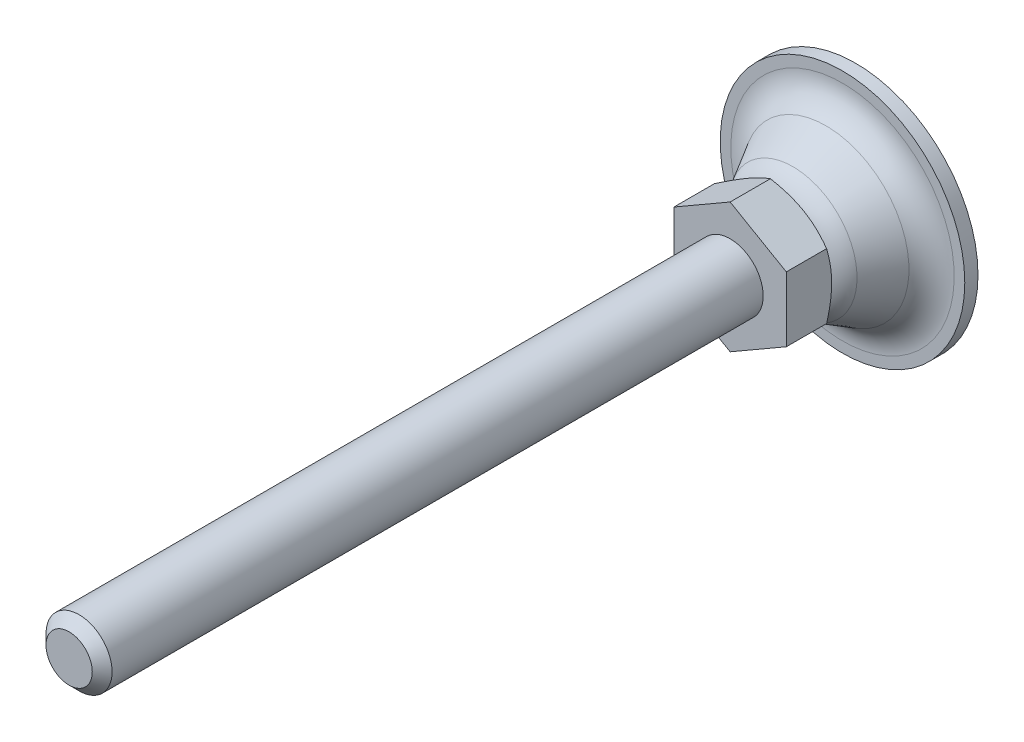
ISO-10303-21;
HEADER;
FILE_DESCRIPTION(('STEP AP214'),'2;1');
FILE_NAME('part.step','',(''),(''),'','','');
FILE_SCHEMA(('AUTOMOTIVE_DESIGN { 1 0 10303 214 1 1 1 1 }'));
ENDSEC;
DATA;
#1=APPLICATION_CONTEXT('core data for automotive mechanical design processes');
#2=APPLICATION_PROTOCOL_DEFINITION('international standard','automotive_design',2000,#1);
#3=PRODUCT_CONTEXT('',#1,'mechanical');
#4=PRODUCT('Part','Part','',(#3));
#5=PRODUCT_RELATED_PRODUCT_CATEGORY('part','',(#4));
#6=PRODUCT_DEFINITION_FORMATION('','',#4);
#7=PRODUCT_DEFINITION_CONTEXT('part definition',#1,'design');
#8=PRODUCT_DEFINITION('design','',#6,#7);
#9=PRODUCT_DEFINITION_SHAPE('','',#8);
#10=(LENGTH_UNIT() NAMED_UNIT(*) SI_UNIT(.MILLI.,.METRE.));
#11=(NAMED_UNIT(*) PLANE_ANGLE_UNIT() SI_UNIT($,.RADIAN.));
#12=(NAMED_UNIT(*) SI_UNIT($,.STERADIAN.) SOLID_ANGLE_UNIT());
#13=UNCERTAINTY_MEASURE_WITH_UNIT(LENGTH_MEASURE(1.E-05),#10,'distance_accuracy_value','');
#14=(GEOMETRIC_REPRESENTATION_CONTEXT(3) GLOBAL_UNCERTAINTY_ASSIGNED_CONTEXT((#13)) GLOBAL_UNIT_ASSIGNED_CONTEXT((#10,
#11,#12)) REPRESENTATION_CONTEXT('',''));
#15=CARTESIAN_POINT('',(0.,0.,0.));
#16=DIRECTION('',(0.,0.,1.));
#17=DIRECTION('',(1.,0.,0.));
#18=AXIS2_PLACEMENT_3D('',#15,#16,#17);
#19=CARTESIAN_POINT('',(-9.25,16.0214699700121,1.99999918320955));
#20=DIRECTION('',(0.,0.,-1.));
#21=DIRECTION('',(-0.5,0.866025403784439,0.));
#22=AXIS2_PLACEMENT_3D('',#19,#20,#21);
#23=PLANE('',#22);
#24=CARTESIAN_POINT('',(0.,0.,1.99999918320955));
#25=DIRECTION('',(0.,0.,1.));
#26=DIRECTION('',(0.5,-0.866025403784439,0.));
#27=AXIS2_PLACEMENT_3D('',#24,#25,#26);
#28=CIRCLE('',#27,16.8976413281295);
#29=CARTESIAN_POINT('',(8.44882066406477,-14.633786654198,1.99999918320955));
#30=VERTEX_POINT('',#29);
#31=EDGE_CURVE('E108',#30,#30,#28,.T.);
#32=ORIENTED_EDGE('',*,*,#31,.F.);
#33=EDGE_LOOP('',(#32));
#34=FACE_BOUND('',#33,.T.);
#35=CARTESIAN_POINT('',(0.,0.,2.));
#36=DIRECTION('',(0.,0.,1.));
#37=DIRECTION('',(1.,0.,0.));
#38=AXIS2_PLACEMENT_3D('',#35,#36,#37);
#39=CIRCLE('',#38,18.5);
#40=CARTESIAN_POINT('',(18.5,0.,2.));
#41=VERTEX_POINT('',#40);
#42=EDGE_CURVE('E245',#41,#41,#39,.T.);
#43=ORIENTED_EDGE('',*,*,#42,.T.);
#44=EDGE_LOOP('',(#43));
#45=FACE_BOUND('',#44,.T.);
#46=ADVANCED_FACE('F14',(#34,#45),#23,.F.);
#47=CARTESIAN_POINT('',(0.,0.,19.));
#48=DIRECTION('',(0.,0.,1.));
#49=DIRECTION('',(0.5,-0.866025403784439,0.));
#50=AXIS2_PLACEMENT_3D('',#47,#48,#49);
#51=PLANE('',#50);
#52=DIRECTION('',(0.,1.,0.));
#53=VECTOR('',#52,1.);
#54=CARTESIAN_POINT('',(8.5,-4.90747728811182,19.));
#55=LINE('',#54,#53);
#56=CARTESIAN_POINT('',(8.5,-4.90747728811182,19.));
#57=VERTEX_POINT('',#56);
#58=CARTESIAN_POINT('',(8.5,4.90747728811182,19.));
#59=VERTEX_POINT('',#58);
#60=EDGE_CURVE('E179',#57,#59,#55,.T.);
#61=ORIENTED_EDGE('',*,*,#60,.T.);
#62=DIRECTION('',(-0.866025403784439,0.5,0.));
#63=VECTOR('',#62,1.);
#64=CARTESIAN_POINT('',(8.5,4.90747728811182,19.));
#65=LINE('',#64,#63);
#66=CARTESIAN_POINT('',(0.,9.81495457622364,19.));
#67=VERTEX_POINT('',#66);
#68=EDGE_CURVE('E181',#59,#67,#65,.T.);
#69=ORIENTED_EDGE('',*,*,#68,.T.);
#70=DIRECTION('',(-0.866025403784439,-0.5,0.));
#71=VECTOR('',#70,1.);
#72=CARTESIAN_POINT('',(0.,9.81495457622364,19.));
#73=LINE('',#72,#71);
#74=CARTESIAN_POINT('',(-8.5,4.90747728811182,19.));
#75=VERTEX_POINT('',#74);
#76=EDGE_CURVE('E183',#67,#75,#73,.T.);
#77=ORIENTED_EDGE('',*,*,#76,.T.);
#78=DIRECTION('',(0.,-1.,0.));
#79=VECTOR('',#78,1.);
#80=CARTESIAN_POINT('',(-8.5,4.90747728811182,19.));
#81=LINE('',#80,#79);
#82=CARTESIAN_POINT('',(-8.5,-4.90747728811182,19.));
#83=VERTEX_POINT('',#82);
#84=EDGE_CURVE('E185',#75,#83,#81,.T.);
#85=ORIENTED_EDGE('',*,*,#84,.T.);
#86=DIRECTION('',(0.866025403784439,-0.5,0.));
#87=VECTOR('',#86,1.);
#88=CARTESIAN_POINT('',(-8.5,-4.90747728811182,19.));
#89=LINE('',#88,#87);
#90=CARTESIAN_POINT('',(0.,-9.81495457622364,19.));
#91=VERTEX_POINT('',#90);
#92=EDGE_CURVE('E187',#83,#91,#89,.T.);
#93=ORIENTED_EDGE('',*,*,#92,.T.);
#94=DIRECTION('',(0.866025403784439,0.5,0.));
#95=VECTOR('',#94,1.);
#96=CARTESIAN_POINT('',(0.,-9.81495457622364,19.));
#97=LINE('',#96,#95);
#98=EDGE_CURVE('E37',#91,#57,#97,.T.);
#99=ORIENTED_EDGE('',*,*,#98,.T.);
#100=EDGE_LOOP('',(#61,#69,#77,#85,#93,#99));
#101=FACE_BOUND('',#100,.T.);
#102=CARTESIAN_POINT('',(0.,0.,19.));
#103=DIRECTION('',(0.,0.,1.));
#104=DIRECTION('',(0.5,-0.866025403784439,0.));
#105=AXIS2_PLACEMENT_3D('',#102,#103,#104);
#106=CIRCLE('',#105,5.);
#107=CARTESIAN_POINT('',(2.5,-4.3301270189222,19.));
#108=VERTEX_POINT('',#107);
#109=EDGE_CURVE('E243',#108,#108,#106,.T.);
#110=ORIENTED_EDGE('',*,*,#109,.F.);
#111=EDGE_LOOP('',(#110));
#112=FACE_BOUND('',#111,.T.);
#113=ADVANCED_FACE('F188',(#101,#112),#51,.T.);
#114=CARTESIAN_POINT('',(0.,0.,12.));
#115=DIRECTION('',(0.,0.,1.));
#116=DIRECTION('',(0.5,-0.866025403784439,0.));
#117=AXIS2_PLACEMENT_3D('',#114,#115,#116);
#118=PLANE('',#117);
#119=CARTESIAN_POINT('',(0.,0.,12.));
#120=DIRECTION('',(0.,0.,1.));
#121=DIRECTION('',(0.5,-0.866025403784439,0.));
#122=AXIS2_PLACEMENT_3D('',#119,#120,#121);
#123=CIRCLE('',#122,5.36011171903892);
#124=CARTESIAN_POINT('',(2.68005585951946,-4.64199291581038,12.));
#125=VERTEX_POINT('',#124);
#126=EDGE_CURVE('E73',#125,#125,#123,.T.);
#127=ORIENTED_EDGE('',*,*,#126,.T.);
#128=EDGE_LOOP('',(#127));
#129=FACE_BOUND('',#128,.T.);
#130=CARTESIAN_POINT('',(0.,0.,12.));
#131=DIRECTION('',(0.,0.,1.));
#132=DIRECTION('',(0.5,-0.866025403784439,0.));
#133=AXIS2_PLACEMENT_3D('',#130,#131,#132);
#134=CIRCLE('',#133,8.25);
#135=CARTESIAN_POINT('',(4.125,-7.14470958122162,12.));
#136=VERTEX_POINT('',#135);
#137=EDGE_CURVE('E84',#136,#136,#134,.T.);
#138=ORIENTED_EDGE('',*,*,#137,.F.);
#139=EDGE_LOOP('',(#138));
#140=FACE_BOUND('',#139,.T.);
#141=ADVANCED_FACE('F125',(#129,#140),#118,.F.);
#142=CARTESIAN_POINT('',(0.,0.,7.));
#143=DIRECTION('',(0.,0.,1.));
#144=DIRECTION('',(0.5,-0.866025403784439,0.));
#145=AXIS2_PLACEMENT_3D('',#142,#143,#144);
#146=TOROIDAL_SURFACE('',#145,5.36011171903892,5.);
#147=ORIENTED_EDGE('',*,*,#126,.F.);
#148=EDGE_LOOP('',(#147));
#149=FACE_BOUND('',#148,.T.);
#150=CARTESIAN_POINT('',(0.,0.,9.49382979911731));
#151=DIRECTION('',(0.,0.,1.));
#152=DIRECTION('',(0.5,-0.866025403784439,0.));
#153=AXIS2_PLACEMENT_3D('',#150,#151,#152);
#154=CIRCLE('',#153,9.69379524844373);
#155=CARTESIAN_POINT('',(4.84689762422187,-8.39507294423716,9.49382979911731));
#156=VERTEX_POINT('',#155);
#157=EDGE_CURVE('E102',#156,#156,#154,.T.);
#158=ORIENTED_EDGE('',*,*,#157,.T.);
#159=EDGE_LOOP('',(#158));
#160=FACE_BOUND('',#159,.T.);
#161=ADVANCED_FACE('F214',(#149,#160),#146,.T.);
#162=CARTESIAN_POINT('',(0.,0.,6.99999918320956));
#163=DIRECTION('',(0.,0.,1.));
#164=DIRECTION('',(0.5,-0.866025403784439,0.));
#165=AXIS2_PLACEMENT_3D('',#162,#163,#164);
#166=TOROIDAL_SURFACE('',#165,16.8976413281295,5.);
#167=CARTESIAN_POINT('',(0.,0.,4.50616938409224));
#168=DIRECTION('',(0.,0.,1.));
#169=DIRECTION('',(0.5,-0.866025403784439,0.));
#170=AXIS2_PLACEMENT_3D('',#167,#168,#169);
#171=CIRCLE('',#170,12.5639577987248);
#172=CARTESIAN_POINT('',(6.28197889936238,-10.8807066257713,4.50616938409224));
#173=VERTEX_POINT('',#172);
#174=EDGE_CURVE('E105',#173,#173,#171,.T.);
#175=ORIENTED_EDGE('',*,*,#174,.F.);
#176=EDGE_LOOP('',(#175));
#177=FACE_BOUND('',#176,.T.);
#178=ORIENTED_EDGE('',*,*,#31,.T.);
#179=EDGE_LOOP('',(#178));
#180=FACE_BOUND('',#179,.T.);
#181=ADVANCED_FACE('F213',(#177,#180),#166,.F.);
#182=CARTESIAN_POINT('',(0.,0.,4.50616938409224));
#183=DIRECTION('',(0.,0.,-1.));
#184=DIRECTION('',(-0.5,0.866025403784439,0.));
#185=AXIS2_PLACEMENT_3D('',#182,#183,#184);
#186=CONICAL_SURFACE('',#185,12.5639577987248,0.522174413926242);
#187=ORIENTED_EDGE('',*,*,#157,.F.);
#188=EDGE_LOOP('',(#187));
#189=FACE_BOUND('',#188,.T.);
#190=ORIENTED_EDGE('',*,*,#174,.T.);
#191=EDGE_LOOP('',(#190));
#192=FACE_BOUND('',#191,.T.);
#193=ADVANCED_FACE('F172',(#189,#192),#186,.T.);
#194=CARTESIAN_POINT('',(0.,0.,14.056761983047));
#195=DIRECTION('',(0.,0.,1.));
#196=DIRECTION('',(0.5,-0.866025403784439,0.));
#197=AXIS2_PLACEMENT_3D('',#194,#195,#196);
#198=CONICAL_SURFACE('',#197,11.8124162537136,1.0471975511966);
#199=ORIENTED_EDGE('',*,*,#137,.T.);
#200=EDGE_LOOP('',(#199));
#201=FACE_BOUND('',#200,.T.);
#202=CARTESIAN_POINT('',(8.5,4.9077082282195,12.9035936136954));
#203=CARTESIAN_POINT('',(8.5,4.69196487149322,12.8413237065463));
#204=CARTESIAN_POINT('',(8.5,4.47541714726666,12.7818798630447));
#205=CARTESIAN_POINT('',(8.5,4.04056304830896,12.6694226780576));
#206=CARTESIAN_POINT('',(8.5,3.82225595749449,12.6164121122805));
#207=CARTESIAN_POINT('',(8.5,3.1638393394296,12.4680709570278));
#208=CARTESIAN_POINT('',(8.5,2.72113075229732,12.3836964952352));
#209=CARTESIAN_POINT('',(8.5,2.05862591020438,12.2847575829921));
#210=CARTESIAN_POINT('',(8.5,1.84080885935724,12.2565727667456));
#211=CARTESIAN_POINT('',(8.5,1.40418973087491,12.2093116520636));
#212=CARTESIAN_POINT('',(8.5,1.1853877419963,12.1902345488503));
#213=CARTESIAN_POINT('',(8.5,0.747407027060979,12.1616723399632));
#214=CARTESIAN_POINT('',(8.5,0.528229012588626,12.1521763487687));
#215=CARTESIAN_POINT('',(8.5,0.0896705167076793,12.1429799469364));
#216=CARTESIAN_POINT('',(8.5,-0.129709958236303,12.1432792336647));
#217=CARTESIAN_POINT('',(8.5,-0.539849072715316,12.1529920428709));
#218=CARTESIAN_POINT('',(8.5,-0.730636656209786,12.1612207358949));
#219=CARTESIAN_POINT('',(8.5,-1.11176497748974,12.1849268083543));
#220=CARTESIAN_POINT('',(8.5,-1.30210568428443,12.2004046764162));
#221=CARTESIAN_POINT('',(8.5,-1.87239091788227,12.257346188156));
#222=CARTESIAN_POINT('',(8.5,-2.25132599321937,12.309310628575));
#223=CARTESIAN_POINT('',(8.5,-3.01321579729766,12.4392225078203));
#224=CARTESIAN_POINT('',(8.5,-3.39607329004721,12.5177206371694));
#225=CARTESIAN_POINT('',(8.5,-4.15607888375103,12.69587890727));
#226=CARTESIAN_POINT('',(8.5,-4.53323671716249,12.7954972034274));
#227=CARTESIAN_POINT('',(8.5,-4.9077082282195,12.9035936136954));
#228=B_SPLINE_CURVE_WITH_KNOTS('',3,(#202,#203,#204,#205,#206,#207,#208,#209,#210,#211,#212,
#213,#214,#215,#216,#217,#218,#219,#220,#221,#222,#223,#224,#225,#226,#227),.UNSPECIFIED.,.F.,
.F.,(4,2,2,2,2,2,2,2,2,2,2,2,4),(0.,0.673596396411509,1.34748239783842,2.69805431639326,
3.35679995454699,4.01548737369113,4.67342558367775,5.33134346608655,5.9040955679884,
6.47688628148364,7.62328361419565,8.79510569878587,9.96462743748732),.UNSPECIFIED.);
#229=CARTESIAN_POINT('',(8.5,4.90747728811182,12.9035269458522));
#230=VERTEX_POINT('',#229);
#231=CARTESIAN_POINT('',(8.5,-4.90747728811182,12.9035269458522));
#232=VERTEX_POINT('',#231);
#233=EDGE_CURVE('E29',#230,#232,#228,.T.);
#234=ORIENTED_EDGE('',*,*,#233,.T.);
#235=CARTESIAN_POINT('',(-7.14326647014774,-13.9391213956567,16.2798199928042));
#236=CARTESIAN_POINT('',(-6.82194425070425,-13.7536059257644,16.0999425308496));
#237=CARTESIAN_POINT('',(-6.49988196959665,-13.5676631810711,15.9217974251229));
#238=CARTESIAN_POINT('',(-5.85388362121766,-13.1946958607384,15.5699467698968));
#239=CARTESIAN_POINT('',(-5.52994726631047,-13.0076711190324,15.3962419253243));
#240=CARTESIAN_POINT('',(-4.87812715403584,-12.6313426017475,15.0533671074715));
#241=CARTESIAN_POINT('',(-4.55023149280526,-12.4420319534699,14.8842272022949));
#242=CARTESIAN_POINT('',(-3.89182428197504,-12.0619003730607,14.5529043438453));
#243=CARTESIAN_POINT('',(-3.56131285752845,-11.8710795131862,14.390721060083));
#244=CARTESIAN_POINT('',(-2.8865671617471,-11.4815149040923,14.0701215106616));
#245=CARTESIAN_POINT('',(-2.54223100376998,-11.2827123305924,13.9119895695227));
#246=CARTESIAN_POINT('',(-1.84952262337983,-10.8827769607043,13.6077574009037));
#247=CARTESIAN_POINT('',(-1.50114995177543,-10.6816439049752,13.4616585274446));
#248=CARTESIAN_POINT('',(-0.800469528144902,-10.2771058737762,13.1853475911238));
#249=CARTESIAN_POINT('',(-0.448171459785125,-10.0737064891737,13.0551031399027));
#250=CARTESIAN_POINT('',(0.261465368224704,-9.66399747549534,12.8146959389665));
#251=CARTESIAN_POINT('',(0.618802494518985,-9.45768878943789,12.7045268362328));
#252=CARTESIAN_POINT('',(1.33680036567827,-9.0431525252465,12.5101667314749));
#253=CARTESIAN_POINT('',(1.69743191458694,-8.83494180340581,12.4258358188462));
#254=CARTESIAN_POINT('',(2.2416450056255,-8.52074022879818,12.3223820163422));
#255=CARTESIAN_POINT('',(2.42360720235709,-8.41568430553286,12.2917364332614));
#256=CARTESIAN_POINT('',(2.78842828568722,-8.20505475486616,12.2387278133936));
#257=CARTESIAN_POINT('',(2.97128708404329,-8.09948117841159,12.2163639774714));
#258=CARTESIAN_POINT('',(3.33527756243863,-7.88933117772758,12.1806435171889));
#259=CARTESIAN_POINT('',(3.51640089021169,-7.78475957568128,12.1671738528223));
#260=CARTESIAN_POINT('',(3.87897840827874,-7.57542534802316,12.1490889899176));
#261=CARTESIAN_POINT('',(4.06043259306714,-7.47066272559,12.1444736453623));
#262=CARTESIAN_POINT('',(4.42334771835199,-7.2611335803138,12.1442074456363));
#263=CARTESIAN_POINT('',(4.6048086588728,-7.15636705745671,12.1485566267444));
#264=CARTESIAN_POINT('',(4.96741117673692,-6.94701839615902,12.1661136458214));
#265=CARTESIAN_POINT('',(5.14855273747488,-6.84243626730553,12.1793219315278));
#266=CARTESIAN_POINT('',(5.58458372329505,-6.59069366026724,12.2215001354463));
#267=CARTESIAN_POINT('',(5.83917140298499,-6.44370739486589,12.2547178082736));
#268=CARTESIAN_POINT('',(6.34643025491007,-6.15084136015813,12.336834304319));
#269=CARTESIAN_POINT('',(6.59910115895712,-6.00496174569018,12.3857352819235));
#270=CARTESIAN_POINT('',(7.35396505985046,-5.56914086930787,12.5533675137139));
#271=CARTESIAN_POINT('',(7.85272201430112,-5.28118340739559,12.6929966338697));
#272=CARTESIAN_POINT('',(8.5984640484,-4.85062904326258,12.9347361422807));
#273=CARTESIAN_POINT('',(8.8493257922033,-4.70579394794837,13.0218147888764));
#274=CARTESIAN_POINT('',(9.34861215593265,-4.41753083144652,13.2049195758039));
#275=CARTESIAN_POINT('',(9.59703675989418,-4.274102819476,13.3009457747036));
#276=CARTESIAN_POINT('',(10.0915285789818,-3.98860783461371,13.5004130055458));
#277=CARTESIAN_POINT('',(10.3375965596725,-3.84654041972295,13.603851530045));
#278=CARTESIAN_POINT('',(10.8276994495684,-3.56357938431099,13.8169360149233));
#279=CARTESIAN_POINT('',(11.0717343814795,-3.42268575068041,13.9265819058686));
#280=CARTESIAN_POINT('',(11.6431211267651,-3.09279545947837,14.1903430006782));
#281=CARTESIAN_POINT('',(11.9697339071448,-2.90422548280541,14.3465887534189));
#282=CARTESIAN_POINT('',(12.6202200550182,-2.52866713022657,14.6665283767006));
#283=CARTESIAN_POINT('',(12.9440932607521,-2.34167884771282,14.8302226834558));
#284=CARTESIAN_POINT('',(13.5896047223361,-1.9689926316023,15.1635818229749));
#285=CARTESIAN_POINT('',(13.911242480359,-1.7832949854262,15.3332479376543));
#286=CARTESIAN_POINT('',(14.5525826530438,-1.41301706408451,15.6773581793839));
#287=CARTESIAN_POINT('',(14.8722851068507,-1.22843676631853,15.8518022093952));
#288=CARTESIAN_POINT('',(15.510412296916,-0.860013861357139,16.2047691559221));
#289=CARTESIAN_POINT('',(15.8288353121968,-0.676172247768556,16.3832962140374));
#290=CARTESIAN_POINT('',(16.4643165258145,-0.309276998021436,16.7435631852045));
#291=CARTESIAN_POINT('',(16.7813747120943,-0.126223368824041,16.925303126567));
#292=CARTESIAN_POINT('',(17.7307434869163,0.421894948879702,17.4744481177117));
#293=CARTESIAN_POINT('',(18.3613310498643,0.785964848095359,17.8458244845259));
#294=CARTESIAN_POINT('',(19.5671290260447,1.48213263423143,18.5650147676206));
#295=CARTESIAN_POINT('',(20.142605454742,1.81438410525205,18.9122366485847));
#296=CARTESIAN_POINT('',(21.2914143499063,2.47764923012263,19.6114287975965));
#297=CARTESIAN_POINT('',(21.8647467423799,2.80866284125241,19.9633992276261));
#298=CARTESIAN_POINT('',(23.00833933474,3.46891633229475,20.670098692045));
#299=CARTESIAN_POINT('',(23.5786036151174,3.79815856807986,21.0248189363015));
#300=CARTESIAN_POINT('',(24.7177587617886,4.45585009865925,21.7371045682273));
#301=CARTESIAN_POINT('',(25.28664970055,4.78429943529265,22.0946698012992));
#302=CARTESIAN_POINT('',(25.8550339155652,5.11245621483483,22.4532986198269));
#303=B_SPLINE_CURVE_WITH_KNOTS('',3,(#235,#236,#237,#238,#239,#240,#241,#242,#243,#244,#245,
#246,#247,#248,#249,#250,#251,#252,#253,#254,#255,#256,#257,#258,#259,#260,#261,#262,#263,#264,
#265,#266,#267,#268,#269,#270,#271,#272,#273,#274,#275,#276,#277,#278,#279,#280,#281,#282,#283,
#284,#285,#286,#287,#288,#289,#290,#291,#292,#293,#294,#295,#296,#297,#298,#299,#300,#301,#302),
.UNSPECIFIED.,.F.,.F.,(4,2,2,2,2,2,2,2,2,2,2,2,2,2,2,2,2,2,2,2,2,2,2,2,2,2,2,2,2,2,2,2,2,4),(0.,
1.23701916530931,2.47423351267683,3.71822790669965,4.96216313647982,6.24570205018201,
7.52938519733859,8.81040031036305,10.0910093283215,11.3645561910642,12.0014235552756,
12.6382294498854,13.2667775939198,13.895315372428,14.5238556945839,15.1524277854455,
16.039455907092,16.9266059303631,18.7019009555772,19.6092533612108,20.5166117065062,
21.4236645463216,22.3307072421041,23.5552735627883,24.7799116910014,26.0048143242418,
27.2296920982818,28.4558728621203,29.6820644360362,32.1341292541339,34.3833630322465,
36.6326737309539,38.8765143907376,41.120233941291),.UNSPECIFIED.);
#304=CARTESIAN_POINT('',(0.,-9.81495457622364,12.9035269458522));
#305=VERTEX_POINT('',#304);
#306=EDGE_CURVE('E65',#232,#305,#303,.F.);
#307=ORIENTED_EDGE('',*,*,#306,.T.);
#308=CARTESIAN_POINT('',(0.000200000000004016,-9.81507004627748,12.9035936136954));
#309=CARTESIAN_POINT('',(-0.186639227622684,-9.70719836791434,12.8413237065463));
#310=CARTESIAN_POINT('',(-0.374175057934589,-9.59892450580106,12.7818798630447));
#311=CARTESIAN_POINT('',(-0.750769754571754,-9.38149745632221,12.6694226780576));
#312=CARTESIAN_POINT('',(-0.939829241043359,-9.27234391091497,12.6164121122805));
#313=CARTESIAN_POINT('',(-1.51003475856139,-8.94313560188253,12.4680709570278));
#314=CARTESIAN_POINT('',(-1.89343164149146,-8.72178130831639,12.3836964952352));
#315=CARTESIAN_POINT('',(-2.46717766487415,-8.39052888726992,12.2847575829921));
#316=CARTESIAN_POINT('',(-2.65581276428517,-8.28162036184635,12.2565727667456));
#317=CARTESIAN_POINT('',(-3.0339360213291,-8.06331079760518,12.2093116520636));
#318=CARTESIAN_POINT('',(-3.22342410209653,-7.95390980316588,12.1902345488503));
#319=CARTESIAN_POINT('',(-3.60272652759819,-7.73491944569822,12.1616723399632));
#320=CARTESIAN_POINT('',(-3.79254025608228,-7.62533043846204,12.1521763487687));
#321=CARTESIAN_POINT('',(-4.17234305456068,-7.40605119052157,12.1429799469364));
#322=CARTESIAN_POINT('',(-4.36233211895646,-7.29636095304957,12.1432792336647));
#323=CARTESIAN_POINT('',(-4.71752301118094,-7.09129139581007,12.1529920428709));
#324=CARTESIAN_POINT('',(-4.88274990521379,-6.99589760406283,12.1612207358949));
#325=CARTESIAN_POINT('',(-5.21281671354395,-6.80533344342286,12.1849268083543));
#326=CARTESIAN_POINT('',(-5.37765660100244,-6.71016309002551,12.2004046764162));
#327=CARTESIAN_POINT('',(-5.87153810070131,-6.42502047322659,12.257346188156));
#328=CARTESIAN_POINT('',(-6.19970550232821,-6.23555293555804,12.309310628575));
#329=CARTESIAN_POINT('',(-6.85952142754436,-5.8546080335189,12.4392225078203));
#330=CARTESIAN_POINT('',(-7.19108574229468,-5.66317928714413,12.5177206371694));
#331=CARTESIAN_POINT('',(-7.84926989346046,-5.28317649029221,12.69587890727));
#332=CARTESIAN_POINT('',(-8.17589815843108,-5.09459757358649,12.7954972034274));
#333=CARTESIAN_POINT('',(-8.5002,-4.90736181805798,12.9035936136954));
#334=B_SPLINE_CURVE_WITH_KNOTS('',3,(#308,#309,#310,#311,#312,#313,#314,#315,#316,#317,#318,
#319,#320,#321,#322,#323,#324,#325,#326,#327,#328,#329,#330,#331,#332,#333),.UNSPECIFIED.,.F.,
.F.,(4,2,2,2,2,2,2,2,2,2,2,2,4),(0.,0.673596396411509,1.34748239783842,2.69805431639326,
3.356799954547,4.01548737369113,4.67342558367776,5.33134346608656,5.9040955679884,
6.47688628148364,7.62328361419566,8.79510569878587,9.96462743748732),.UNSPECIFIED.);
#335=CARTESIAN_POINT('',(-8.5,-4.90747728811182,12.9035269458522));
#336=VERTEX_POINT('',#335);
#337=EDGE_CURVE('E68',#305,#336,#334,.T.);
#338=ORIENTED_EDGE('',*,*,#337,.T.);
#339=CARTESIAN_POINT('',(-8.5,-4.9077082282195,12.9035936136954));
#340=CARTESIAN_POINT('',(-8.5,-4.69196487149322,12.8413237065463));
#341=CARTESIAN_POINT('',(-8.5,-4.47541714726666,12.7818798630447));
#342=CARTESIAN_POINT('',(-8.5,-4.04056304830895,12.6694226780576));
#343=CARTESIAN_POINT('',(-8.5,-3.82225595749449,12.6164121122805));
#344=CARTESIAN_POINT('',(-8.5,-3.1638393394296,12.4680709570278));
#345=CARTESIAN_POINT('',(-8.5,-2.72113075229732,12.3836964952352));
#346=CARTESIAN_POINT('',(-8.5,-2.05862591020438,12.2847575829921));
#347=CARTESIAN_POINT('',(-8.5,-1.84080885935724,12.2565727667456));
#348=CARTESIAN_POINT('',(-8.5,-1.40418973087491,12.2093116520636));
#349=CARTESIAN_POINT('',(-8.5,-1.1853877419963,12.1902345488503));
#350=CARTESIAN_POINT('',(-8.5,-0.747407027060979,12.1616723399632));
#351=CARTESIAN_POINT('',(-8.5,-0.528229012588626,12.1521763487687));
#352=CARTESIAN_POINT('',(-8.5,-0.0896705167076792,12.1429799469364));
#353=CARTESIAN_POINT('',(-8.5,0.129709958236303,12.1432792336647));
#354=CARTESIAN_POINT('',(-8.5,0.539849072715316,12.1529920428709));
#355=CARTESIAN_POINT('',(-8.5,0.730636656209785,12.1612207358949));
#356=CARTESIAN_POINT('',(-8.5,1.11176497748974,12.1849268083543));
#357=CARTESIAN_POINT('',(-8.5,1.30210568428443,12.2004046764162));
#358=CARTESIAN_POINT('',(-8.5,1.87239091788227,12.257346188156));
#359=CARTESIAN_POINT('',(-8.5,2.25132599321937,12.309310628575));
#360=CARTESIAN_POINT('',(-8.5,3.01321579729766,12.4392225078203));
#361=CARTESIAN_POINT('',(-8.5,3.3960732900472,12.5177206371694));
#362=CARTESIAN_POINT('',(-8.5,4.15607888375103,12.69587890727));
#363=CARTESIAN_POINT('',(-8.5,4.53323671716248,12.7954972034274));
#364=CARTESIAN_POINT('',(-8.5,4.90770822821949,12.9035936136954));
#365=B_SPLINE_CURVE_WITH_KNOTS('',3,(#339,#340,#341,#342,#343,#344,#345,#346,#347,#348,#349,
#350,#351,#352,#353,#354,#355,#356,#357,#358,#359,#360,#361,#362,#363,#364),.UNSPECIFIED.,.F.,
.F.,(4,2,2,2,2,2,2,2,2,2,2,2,4),(0.,0.673596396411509,1.34748239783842,2.69805431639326,
3.35679995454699,4.01548737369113,4.67342558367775,5.33134346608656,5.9040955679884,
6.47688628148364,7.62328361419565,8.79510569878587,9.96462743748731),.UNSPECIFIED.);
#366=CARTESIAN_POINT('',(-8.5,4.90747728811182,12.9035269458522));
#367=VERTEX_POINT('',#366);
#368=EDGE_CURVE('E83',#336,#367,#365,.T.);
#369=ORIENTED_EDGE('',*,*,#368,.T.);
#370=CARTESIAN_POINT('',(-15.643266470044,0.7833104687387,16.2798199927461));
#371=CARTESIAN_POINT('',(-15.321944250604,0.968825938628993,16.099942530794));
#372=CARTESIAN_POINT('',(-14.9998819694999,1.15476868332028,15.9217974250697));
#373=CARTESIAN_POINT('',(-14.3538836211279,1.52773600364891,15.5699467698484));
#374=CARTESIAN_POINT('',(-14.0299472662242,1.71476074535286,15.3962419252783));
#375=CARTESIAN_POINT('',(-13.3781271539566,2.09108926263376,15.0533671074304));
#376=CARTESIAN_POINT('',(-13.0502314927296,2.28039991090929,14.8842272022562));
#377=CARTESIAN_POINT('',(-12.3918242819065,2.66053149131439,14.5529043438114));
#378=CARTESIAN_POINT('',(-12.0613128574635,2.85135235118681,14.3907210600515));
#379=CARTESIAN_POINT('',(-11.3865671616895,3.24091696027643,14.0701215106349));
#380=CARTESIAN_POINT('',(-11.0422310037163,3.43971953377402,13.9119895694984));
#381=CARTESIAN_POINT('',(-10.3495226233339,3.83965490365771,13.6077574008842));
#382=CARTESIAN_POINT('',(-10.0011499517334,4.04078795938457,13.4616585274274));
#383=CARTESIAN_POINT('',(-9.30046952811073,4.445325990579,13.1853475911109));
#384=CARTESIAN_POINT('',(-8.94817145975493,4.64872537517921,13.055103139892));
#385=CARTESIAN_POINT('',(-8.23853463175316,5.0584343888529,12.8146959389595));
#386=CARTESIAN_POINT('',(-7.88119750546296,5.26474307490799,12.7045268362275));
#387=CARTESIAN_POINT('',(-7.16319963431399,5.67927933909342,12.5101667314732));
#388=CARTESIAN_POINT('',(-6.80256808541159,5.8874900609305,12.4258358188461));
#389=CARTESIAN_POINT('',(-6.25835499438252,6.20169163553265,12.3223820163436));
#390=CARTESIAN_POINT('',(-6.07639279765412,6.30674755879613,12.2917364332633));
#391=CARTESIAN_POINT('',(-5.71157171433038,6.51737710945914,12.2387278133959));
#392=CARTESIAN_POINT('',(-5.52871291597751,6.62295068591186,12.2163639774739));
#393=CARTESIAN_POINT('',(-5.16472243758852,6.83310068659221,12.1806435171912));
#394=CARTESIAN_POINT('',(-4.9835991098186,6.93767228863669,12.1671738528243));
#395=CARTESIAN_POINT('',(-4.62102159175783,7.14700651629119,12.1490889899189));
#396=CARTESIAN_POINT('',(-4.43956740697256,7.25176913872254,12.144473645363));
#397=CARTESIAN_POINT('',(-4.07665228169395,7.46129828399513,12.1442074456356));
#398=CARTESIAN_POINT('',(-3.89519134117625,7.56606480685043,12.1485566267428));
#399=CARTESIAN_POINT('',(-3.5325888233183,7.77541346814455,12.1661136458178));
#400=CARTESIAN_POINT('',(-3.35144726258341,7.87999559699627,12.1793219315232));
#401=CARTESIAN_POINT('',(-2.91541627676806,8.13173820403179,12.2215001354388));
#402=CARTESIAN_POINT('',(-2.66082859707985,8.27872446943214,12.2547178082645));
#403=CARTESIAN_POINT('',(-2.15356974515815,8.57159050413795,12.3368343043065));
#404=CARTESIAN_POINT('',(-1.90089884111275,8.71747011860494,12.3857352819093));
#405=CARTESIAN_POINT('',(-1.14603494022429,9.15329099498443,12.5533675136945));
#406=CARTESIAN_POINT('',(-0.647277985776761,9.44124845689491,12.6929966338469));
#407=CARTESIAN_POINT('',(0.0984640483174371,9.87180282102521,12.9347361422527));
#408=CARTESIAN_POINT('',(0.349325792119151,10.0166379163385,13.0218147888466));
#409=CARTESIAN_POINT('',(0.848612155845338,10.3049010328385,13.2049195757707));
#410=CARTESIAN_POINT('',(1.09703675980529,10.4483290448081,13.3009457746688));
#411=CARTESIAN_POINT('',(1.59152857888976,10.7338240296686,13.5004130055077));
#412=CARTESIAN_POINT('',(1.83759655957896,10.8758914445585,13.6038515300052));
#413=CARTESIAN_POINT('',(2.32769944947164,11.1588524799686,13.8169360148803));
#414=CARTESIAN_POINT('',(2.57173438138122,11.2997461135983,13.9265819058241));
#415=CARTESIAN_POINT('',(3.14312112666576,11.6296364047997,14.1903430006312));
#416=CARTESIAN_POINT('',(3.46973390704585,11.8182063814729,14.3465887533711));
#417=CARTESIAN_POINT('',(4.12022005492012,12.1937647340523,14.6665283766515));
#418=CARTESIAN_POINT('',(4.44409326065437,12.3807530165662,14.830222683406));
#419=CARTESIAN_POINT('',(5.08960472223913,12.7534392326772,15.1635818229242));
#420=CARTESIAN_POINT('',(5.41124248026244,12.9391368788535,15.3332479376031));
#421=CARTESIAN_POINT('',(6.05258265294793,13.3094148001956,15.6773581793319));
#422=CARTESIAN_POINT('',(6.37228510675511,13.4939950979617,15.8518022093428));
#423=CARTESIAN_POINT('',(7.01041229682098,13.8624180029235,16.2047691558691));
#424=CARTESIAN_POINT('',(7.32883531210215,14.0462596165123,16.3832962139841));
#425=CARTESIAN_POINT('',(7.96431652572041,14.4131548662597,16.7435631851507));
#426=CARTESIAN_POINT('',(8.28137471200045,14.5962084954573,16.9253031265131));
#427=CARTESIAN_POINT('',(9.23074348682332,15.1443268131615,17.4744481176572));
#428=CARTESIAN_POINT('',(9.86133104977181,15.5083967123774,17.8458244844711));
#429=CARTESIAN_POINT('',(11.0671290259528,16.2045644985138,18.5650147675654));
#430=CARTESIAN_POINT('',(11.6426054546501,16.5368159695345,18.9122366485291));
#431=CARTESIAN_POINT('',(12.7914143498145,17.2000810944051,19.6114287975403));
#432=CARTESIAN_POINT('',(13.3647467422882,17.5310947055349,19.9633992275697));
#433=CARTESIAN_POINT('',(14.5083393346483,18.1913481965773,20.6700986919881));
#434=CARTESIAN_POINT('',(15.0786036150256,18.5205904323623,21.0248189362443));
#435=CARTESIAN_POINT('',(16.2177587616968,19.1782819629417,21.7371045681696));
#436=CARTESIAN_POINT('',(16.7866497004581,19.506731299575,22.0946698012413));
#437=CARTESIAN_POINT('',(17.3550339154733,19.8348880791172,22.4532986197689));
#438=B_SPLINE_CURVE_WITH_KNOTS('',3,(#370,#371,#372,#373,#374,#375,#376,#377,#378,#379,#380,
#381,#382,#383,#384,#385,#386,#387,#388,#389,#390,#391,#392,#393,#394,#395,#396,#397,#398,#399,
#400,#401,#402,#403,#404,#405,#406,#407,#408,#409,#410,#411,#412,#413,#414,#415,#416,#417,#418,
#419,#420,#421,#422,#423,#424,#425,#426,#427,#428,#429,#430,#431,#432,#433,#434,#435,#436,#437),
.UNSPECIFIED.,.F.,.F.,(4,2,2,2,2,2,2,2,2,2,2,2,2,2,2,2,2,2,2,2,2,2,2,2,2,2,2,2,2,2,2,2,2,4),(0.,
1.23701916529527,2.47423351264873,3.71822790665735,4.96216313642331,6.24570205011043,
7.52938519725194,8.81040031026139,10.0910093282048,11.3645561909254,12.0014235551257,
12.6382294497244,13.2667775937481,13.8953153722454,14.5238556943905,15.1524277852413,
16.0394559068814,16.9266059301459,18.701900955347,19.6092533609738,20.5166117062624,
21.4236645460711,22.3307072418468,23.5552735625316,24.7799116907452,26.0048143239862,
27.2296920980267,28.4558728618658,29.6820644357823,32.1341292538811,34.3833630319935,
36.6326737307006,38.876514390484,41.1202339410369),.UNSPECIFIED.);
#439=CARTESIAN_POINT('',(0.,9.81495457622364,12.9035269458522));
#440=VERTEX_POINT('',#439);
#441=EDGE_CURVE('E144',#367,#440,#438,.T.);
#442=ORIENTED_EDGE('',*,*,#441,.T.);
#443=CARTESIAN_POINT('',(-0.000200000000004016,9.81507004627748,12.9035936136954));
#444=CARTESIAN_POINT('',(0.186639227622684,9.70719836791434,12.8413237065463));
#445=CARTESIAN_POINT('',(0.374175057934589,9.59892450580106,12.7818798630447));
#446=CARTESIAN_POINT('',(0.750769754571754,9.38149745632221,12.6694226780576));
#447=CARTESIAN_POINT('',(0.939829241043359,9.27234391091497,12.6164121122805));
#448=CARTESIAN_POINT('',(1.51003475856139,8.94313560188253,12.4680709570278));
#449=CARTESIAN_POINT('',(1.89343164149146,8.72178130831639,12.3836964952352));
#450=CARTESIAN_POINT('',(2.46717766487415,8.39052888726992,12.2847575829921));
#451=CARTESIAN_POINT('',(2.65581276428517,8.28162036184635,12.2565727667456));
#452=CARTESIAN_POINT('',(3.0339360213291,8.06331079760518,12.2093116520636));
#453=CARTESIAN_POINT('',(3.22342410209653,7.95390980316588,12.1902345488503));
#454=CARTESIAN_POINT('',(3.60272652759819,7.73491944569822,12.1616723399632));
#455=CARTESIAN_POINT('',(3.79254025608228,7.62533043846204,12.1521763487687));
#456=CARTESIAN_POINT('',(4.17234305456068,7.40605119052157,12.1429799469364));
#457=CARTESIAN_POINT('',(4.36233211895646,7.29636095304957,12.1432792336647));
#458=CARTESIAN_POINT('',(4.71752301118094,7.09129139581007,12.1529920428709));
#459=CARTESIAN_POINT('',(4.88274990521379,6.99589760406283,12.1612207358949));
#460=CARTESIAN_POINT('',(5.21281671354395,6.80533344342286,12.1849268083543));
#461=CARTESIAN_POINT('',(5.37765660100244,6.71016309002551,12.2004046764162));
#462=CARTESIAN_POINT('',(5.87153810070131,6.42502047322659,12.257346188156));
#463=CARTESIAN_POINT('',(6.19970550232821,6.23555293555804,12.309310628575));
#464=CARTESIAN_POINT('',(6.85952142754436,5.8546080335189,12.4392225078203));
#465=CARTESIAN_POINT('',(7.19108574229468,5.66317928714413,12.5177206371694));
#466=CARTESIAN_POINT('',(7.84926989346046,5.28317649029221,12.69587890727));
#467=CARTESIAN_POINT('',(8.17589815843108,5.09459757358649,12.7954972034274));
#468=CARTESIAN_POINT('',(8.5002,4.90736181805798,12.9035936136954));
#469=B_SPLINE_CURVE_WITH_KNOTS('',3,(#443,#444,#445,#446,#447,#448,#449,#450,#451,#452,#453,
#454,#455,#456,#457,#458,#459,#460,#461,#462,#463,#464,#465,#466,#467,#468),.UNSPECIFIED.,.F.,
.F.,(4,2,2,2,2,2,2,2,2,2,2,2,4),(0.,0.673596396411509,1.34748239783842,2.69805431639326,
3.356799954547,4.01548737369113,4.67342558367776,5.33134346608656,5.9040955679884,
6.47688628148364,7.62328361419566,8.79510569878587,9.96462743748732),.UNSPECIFIED.);
#470=EDGE_CURVE('E150',#440,#230,#469,.T.);
#471=ORIENTED_EDGE('',*,*,#470,.T.);
#472=EDGE_LOOP('',(#234,#307,#338,#369,#442,#471));
#473=FACE_BOUND('',#472,.T.);
#474=ADVANCED_FACE('F67',(#201,#473),#198,.T.);
#475=CARTESIAN_POINT('',(0.,-9.81495457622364,19.));
#476=DIRECTION('',(-0.5,0.866025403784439,0.));
#477=DIRECTION('',(-0.866025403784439,-0.5,0.));
#478=AXIS2_PLACEMENT_3D('',#475,#476,#477);
#479=PLANE('',#478);
#480=ORIENTED_EDGE('',*,*,#306,.F.);
#481=DIRECTION('',(0.,0.,-1.));
#482=VECTOR('',#481,1.);
#483=CARTESIAN_POINT('',(8.5,-4.90747728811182,19.));
#484=LINE('',#483,#482);
#485=EDGE_CURVE('E87',#57,#232,#484,.T.);
#486=ORIENTED_EDGE('',*,*,#485,.F.);
#487=ORIENTED_EDGE('',*,*,#98,.F.);
#488=DIRECTION('',(0.,0.,-1.));
#489=VECTOR('',#488,1.);
#490=CARTESIAN_POINT('',(0.,-9.81495457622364,19.));
#491=LINE('',#490,#489);
#492=EDGE_CURVE('E80',#91,#305,#491,.T.);
#493=ORIENTED_EDGE('',*,*,#492,.T.);
#494=EDGE_LOOP('',(#480,#486,#487,#493));
#495=FACE_BOUND('',#494,.T.);
#496=ADVANCED_FACE('F86',(#495),#479,.F.);
#497=CARTESIAN_POINT('',(-8.5,-4.90747728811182,19.));
#498=DIRECTION('',(0.5,0.866025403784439,0.));
#499=DIRECTION('',(-0.866025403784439,0.5,0.));
#500=AXIS2_PLACEMENT_3D('',#497,#498,#499);
#501=PLANE('',#500);
#502=ORIENTED_EDGE('',*,*,#337,.F.);
#503=ORIENTED_EDGE('',*,*,#492,.F.);
#504=ORIENTED_EDGE('',*,*,#92,.F.);
#505=DIRECTION('',(0.,0.,-1.));
#506=VECTOR('',#505,1.);
#507=CARTESIAN_POINT('',(-8.5,-4.90747728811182,19.));
#508=LINE('',#507,#506);
#509=EDGE_CURVE('E82',#83,#336,#508,.T.);
#510=ORIENTED_EDGE('',*,*,#509,.T.);
#511=EDGE_LOOP('',(#502,#503,#504,#510));
#512=FACE_BOUND('',#511,.T.);
#513=ADVANCED_FACE('F78',(#512),#501,.F.);
#514=CARTESIAN_POINT('',(-8.5,4.90747728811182,19.));
#515=DIRECTION('',(1.,0.,0.));
#516=DIRECTION('',(0.,1.,0.));
#517=AXIS2_PLACEMENT_3D('',#514,#515,#516);
#518=PLANE('',#517);
#519=ORIENTED_EDGE('',*,*,#368,.F.);
#520=ORIENTED_EDGE('',*,*,#509,.F.);
#521=ORIENTED_EDGE('',*,*,#84,.F.);
#522=DIRECTION('',(0.,0.,-1.));
#523=VECTOR('',#522,1.);
#524=CARTESIAN_POINT('',(-8.5,4.90747728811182,19.));
#525=LINE('',#524,#523);
#526=EDGE_CURVE('E89',#75,#367,#525,.T.);
#527=ORIENTED_EDGE('',*,*,#526,.T.);
#528=EDGE_LOOP('',(#519,#520,#521,#527));
#529=FACE_BOUND('',#528,.T.);
#530=ADVANCED_FACE('F129',(#529),#518,.F.);
#531=CARTESIAN_POINT('',(0.,9.81495457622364,19.));
#532=DIRECTION('',(0.5,-0.866025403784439,0.));
#533=DIRECTION('',(0.866025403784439,0.5,0.));
#534=AXIS2_PLACEMENT_3D('',#531,#532,#533);
#535=PLANE('',#534);
#536=ORIENTED_EDGE('',*,*,#441,.F.);
#537=ORIENTED_EDGE('',*,*,#526,.F.);
#538=ORIENTED_EDGE('',*,*,#76,.F.);
#539=DIRECTION('',(0.,0.,-1.));
#540=VECTOR('',#539,1.);
#541=CARTESIAN_POINT('',(0.,9.81495457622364,19.));
#542=LINE('',#541,#540);
#543=EDGE_CURVE('E96',#67,#440,#542,.T.);
#544=ORIENTED_EDGE('',*,*,#543,.T.);
#545=EDGE_LOOP('',(#536,#537,#538,#544));
#546=FACE_BOUND('',#545,.T.);
#547=ADVANCED_FACE('F157',(#546),#535,.F.);
#548=CARTESIAN_POINT('',(8.5,4.90747728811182,19.));
#549=DIRECTION('',(-0.5,-0.866025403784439,0.));
#550=DIRECTION('',(0.866025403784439,-0.5,0.));
#551=AXIS2_PLACEMENT_3D('',#548,#549,#550);
#552=PLANE('',#551);
#553=ORIENTED_EDGE('',*,*,#470,.F.);
#554=ORIENTED_EDGE('',*,*,#543,.F.);
#555=ORIENTED_EDGE('',*,*,#68,.F.);
#556=DIRECTION('',(0.,0.,-1.));
#557=VECTOR('',#556,1.);
#558=CARTESIAN_POINT('',(8.5,4.90747728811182,19.));
#559=LINE('',#558,#557);
#560=EDGE_CURVE('E99',#59,#230,#559,.T.);
#561=ORIENTED_EDGE('',*,*,#560,.T.);
#562=EDGE_LOOP('',(#553,#554,#555,#561));
#563=FACE_BOUND('',#562,.T.);
#564=ADVANCED_FACE('F160',(#563),#552,.F.);
#565=CARTESIAN_POINT('',(8.5,-4.90747728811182,19.));
#566=DIRECTION('',(-1.,0.,0.));
#567=DIRECTION('',(0.,-1.,0.));
#568=AXIS2_PLACEMENT_3D('',#565,#566,#567);
#569=PLANE('',#568);
#570=ORIENTED_EDGE('',*,*,#233,.F.);
#571=ORIENTED_EDGE('',*,*,#560,.F.);
#572=ORIENTED_EDGE('',*,*,#60,.F.);
#573=ORIENTED_EDGE('',*,*,#485,.T.);
#574=EDGE_LOOP('',(#570,#571,#572,#573));
#575=FACE_BOUND('',#574,.T.);
#576=ADVANCED_FACE('F165',(#575),#569,.F.);
#577=CARTESIAN_POINT('',(0.,0.,69.));
#578=DIRECTION('',(0.,0.,-1.));
#579=DIRECTION('',(-0.5,0.866025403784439,0.));
#580=AXIS2_PLACEMENT_3D('',#577,#578,#579);
#581=CYLINDRICAL_SURFACE('',#580,5.);
#582=CARTESIAN_POINT('',(0.,0.,117.5));
#583=DIRECTION('',(0.,0.,1.));
#584=DIRECTION('',(1.,0.,0.));
#585=AXIS2_PLACEMENT_3D('',#582,#583,#584);
#586=CIRCLE('',#585,5.);
#587=CARTESIAN_POINT('',(5.,0.,117.5));
#588=VERTEX_POINT('',#587);
#589=EDGE_CURVE('E9',#588,#588,#586,.F.);
#590=ORIENTED_EDGE('',*,*,#589,.T.);
#591=EDGE_LOOP('',(#590));
#592=FACE_BOUND('',#591,.T.);
#593=ORIENTED_EDGE('',*,*,#109,.T.);
#594=EDGE_LOOP('',(#593));
#595=FACE_BOUND('',#594,.T.);
#596=ADVANCED_FACE('F170',(#592,#595),#581,.T.);
#597=CARTESIAN_POINT('',(0.,0.,73.0240046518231));
#598=DIRECTION('',(0.,0.,1.));
#599=DIRECTION('',(1.,0.,0.));
#600=AXIS2_PLACEMENT_3D('',#597,#598,#599);
#601=CYLINDRICAL_SURFACE('',#600,18.5);
#602=ORIENTED_EDGE('',*,*,#42,.F.);
#603=EDGE_LOOP('',(#602));
#604=FACE_BOUND('',#603,.T.);
#605=CARTESIAN_POINT('',(0.,0.,0.));
#606=DIRECTION('',(0.,0.,1.));
#607=DIRECTION('',(1.,0.,0.));
#608=AXIS2_PLACEMENT_3D('',#605,#606,#607);
#609=CIRCLE('',#608,18.5);
#610=CARTESIAN_POINT('',(18.5,0.,0.));
#611=VERTEX_POINT('',#610);
#612=EDGE_CURVE('E249',#611,#611,#609,.T.);
#613=ORIENTED_EDGE('',*,*,#612,.T.);
#614=EDGE_LOOP('',(#613));
#615=FACE_BOUND('',#614,.T.);
#616=ADVANCED_FACE('F255',(#604,#615),#601,.T.);
#617=CARTESIAN_POINT('',(0.,0.,0.));
#618=DIRECTION('',(0.,0.,1.));
#619=DIRECTION('',(1.,0.,0.));
#620=AXIS2_PLACEMENT_3D('',#617,#618,#619);
#621=PLANE('',#620);
#622=ORIENTED_EDGE('',*,*,#612,.F.);
#623=EDGE_LOOP('',(#622));
#624=FACE_BOUND('',#623,.T.);
#625=ADVANCED_FACE('F257',(#624),#621,.F.);
#626=CARTESIAN_POINT('',(0.,0.,119.));
#627=DIRECTION('',(0.,0.,1.));
#628=DIRECTION('',(1.,0.,0.));
#629=AXIS2_PLACEMENT_3D('',#626,#627,#628);
#630=PLANE('',#629);
#631=CARTESIAN_POINT('',(0.,0.,119.));
#632=DIRECTION('',(0.,0.,1.));
#633=DIRECTION('',(1.,0.,0.));
#634=AXIS2_PLACEMENT_3D('',#631,#632,#633);
#635=CIRCLE('',#634,3.5);
#636=CARTESIAN_POINT('',(3.5,0.,119.));
#637=VERTEX_POINT('',#636);
#638=EDGE_CURVE('E22',#637,#637,#635,.T.);
#639=ORIENTED_EDGE('',*,*,#638,.T.);
#640=EDGE_LOOP('',(#639));
#641=FACE_BOUND('',#640,.T.);
#642=ADVANCED_FACE('F259',(#641),#630,.T.);
#643=CARTESIAN_POINT('',(0.,0.,119.));
#644=DIRECTION('',(0.,0.,-1.));
#645=DIRECTION('',(-1.,0.,0.));
#646=AXIS2_PLACEMENT_3D('',#643,#644,#645);
#647=CONICAL_SURFACE('',#646,3.5,0.785398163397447);
#648=ORIENTED_EDGE('',*,*,#589,.F.);
#649=EDGE_LOOP('',(#648));
#650=FACE_BOUND('',#649,.T.);
#651=ORIENTED_EDGE('',*,*,#638,.F.);
#652=EDGE_LOOP('',(#651));
#653=FACE_BOUND('',#652,.T.);
#654=ADVANCED_FACE('F16',(#650,#653),#647,.T.);
#655=CLOSED_SHELL('',(#46,#113,#141,#161,#181,#193,#474,#496,#513,#530,#547,#564,#576,#596,#616,
#625,#642,#654));
#656=MANIFOLD_SOLID_BREP('B1',#655);
#657=ADVANCED_BREP_SHAPE_REPRESENTATION('',(#18,#656),#14);
#658=SHAPE_DEFINITION_REPRESENTATION(#9,#657);
ENDSEC;
END-ISO-10303-21;
